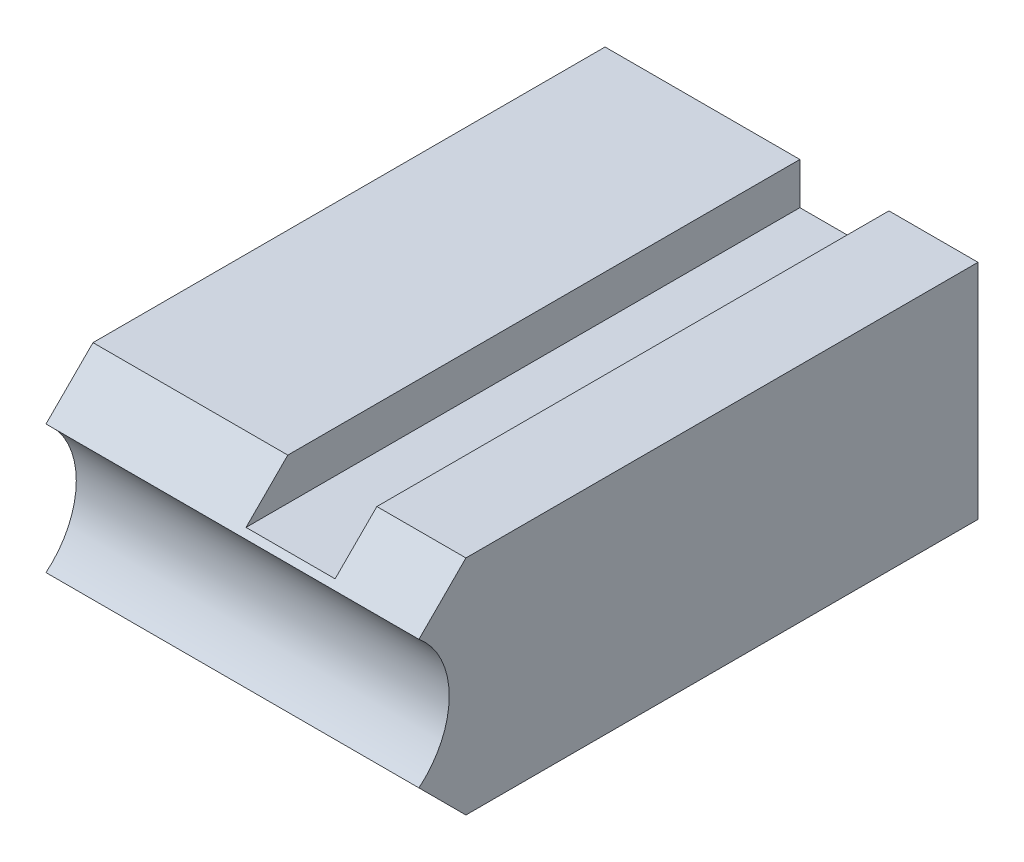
from build123d import *

# Parameters (mm, degrees)
BOSS_EXTRU_1_DEPTH      = 110
ESQUISSE2_W             = 35
ESQUISSE2_H             = 40
BOSS_EXTRU_2_DEPTH      = 110
ENL_V_MAT_EXTRU_1_DEPTH = 131.341858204


with BuildPart() as part:
    # Esquisse1 → Boss.-Extru.1 (new body)
    with BuildSketch(Plane.XY):
        Polygon((118, 12.5), (134, 12.5), (134, 20), (150, 20), (150, -20), (134, -20), (134, -12.5), (118, -12.5), align=None)
    extrude(amount=-BOSS_EXTRU_1_DEPTH)

    # Esquisse2 → Boss.-Extru.2 (add)
    with BuildSketch(Plane.XY):
        with Locations((100.5, 0)):
            Rectangle(ESQUISSE2_W, ESQUISSE2_H)
    extrude(amount=-BOSS_EXTRU_2_DEPTH)

    # Esquisse3 → Enl_v. mat.-Extru.1 (cut, through all)
    with BuildSketch(Plane.ZY.offset(-83)):
        with BuildLine():
            Line((0, 20), (0, -20))
            Line((0, -20), (-18, -20))
            Line((-18, -20), (-9.559356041, -11.559356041))
            ThreePointArc((-9.559356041, -11.559356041), (-15, 0), (-9.559356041, 11.559356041))
            Line((-9.559356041, 11.559356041), (-18, 20))
            Line((-18, 20), (0, 20))
        make_face()
    extrude(amount=-ENL_V_MAT_EXTRU_1_DEPTH, mode=Mode.SUBTRACT)


solid = part.part
